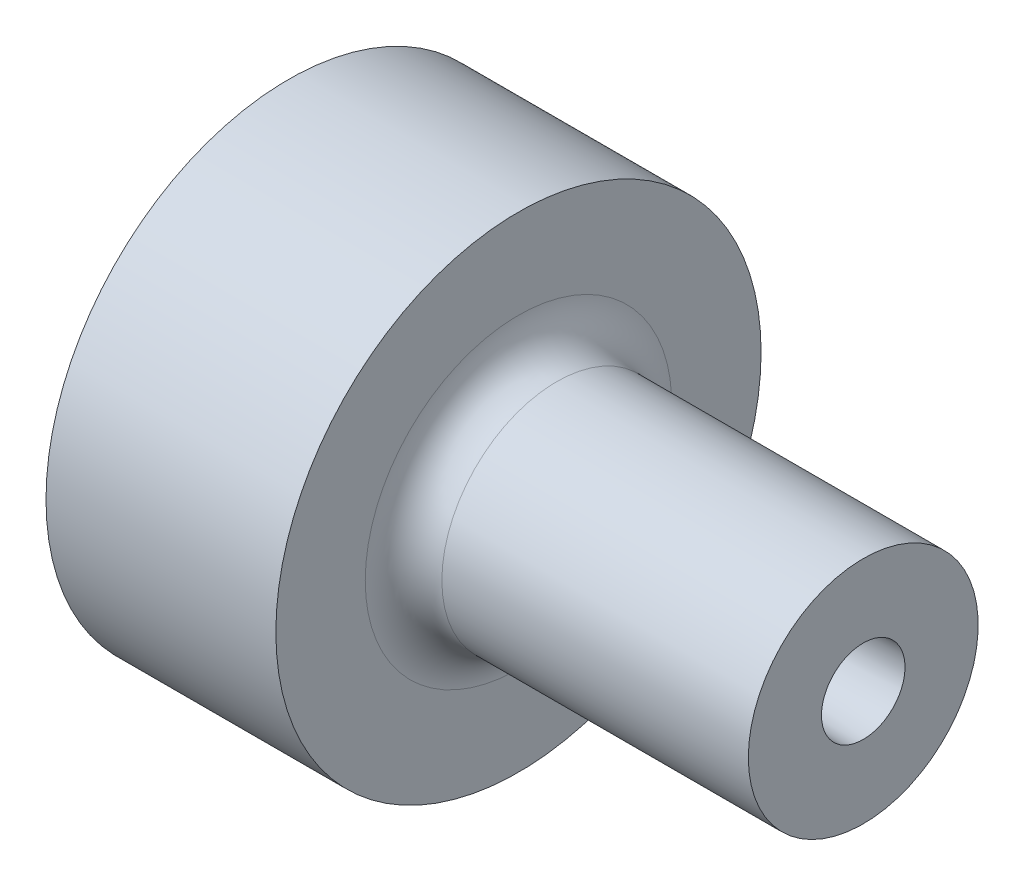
ISO-10303-21;
HEADER;
FILE_DESCRIPTION(('STEP AP214'),'2;1');
FILE_NAME('part.step','',(''),(''),'','','');
FILE_SCHEMA(('AUTOMOTIVE_DESIGN { 1 0 10303 214 1 1 1 1 }'));
ENDSEC;
DATA;
#1=APPLICATION_CONTEXT('core data for automotive mechanical design processes');
#2=APPLICATION_PROTOCOL_DEFINITION('international standard','automotive_design',2000,#1);
#3=PRODUCT_CONTEXT('',#1,'mechanical');
#4=PRODUCT('Part','Part','',(#3));
#5=PRODUCT_RELATED_PRODUCT_CATEGORY('part','',(#4));
#6=PRODUCT_DEFINITION_FORMATION('','',#4);
#7=PRODUCT_DEFINITION_CONTEXT('part definition',#1,'design');
#8=PRODUCT_DEFINITION('design','',#6,#7);
#9=PRODUCT_DEFINITION_SHAPE('','',#8);
#10=(LENGTH_UNIT() NAMED_UNIT(*) SI_UNIT(.MILLI.,.METRE.));
#11=(NAMED_UNIT(*) PLANE_ANGLE_UNIT() SI_UNIT($,.RADIAN.));
#12=(NAMED_UNIT(*) SI_UNIT($,.STERADIAN.) SOLID_ANGLE_UNIT());
#13=UNCERTAINTY_MEASURE_WITH_UNIT(LENGTH_MEASURE(1.E-05),#10,'distance_accuracy_value','');
#14=(GEOMETRIC_REPRESENTATION_CONTEXT(3) GLOBAL_UNCERTAINTY_ASSIGNED_CONTEXT((#13)) GLOBAL_UNIT_ASSIGNED_CONTEXT((#10,
#11,#12)) REPRESENTATION_CONTEXT('',''));
#15=CARTESIAN_POINT('',(0.,0.,0.));
#16=DIRECTION('',(0.,0.,1.));
#17=DIRECTION('',(1.,0.,0.));
#18=AXIS2_PLACEMENT_3D('',#15,#16,#17);
#19=CARTESIAN_POINT('',(0.,0.,0.));
#20=DIRECTION('',(-1.,0.,0.));
#21=DIRECTION('',(0.,0.,1.));
#22=AXIS2_PLACEMENT_3D('',#19,#20,#21);
#23=CYLINDRICAL_SURFACE('',#22,19.);
#24=CARTESIAN_POINT('',(18.,0.,0.));
#25=DIRECTION('',(-1.,0.,0.));
#26=DIRECTION('',(0.,0.,1.));
#27=AXIS2_PLACEMENT_3D('',#24,#25,#26);
#28=CIRCLE('',#27,19.);
#29=CARTESIAN_POINT('',(18.,0.,19.));
#30=VERTEX_POINT('',#29);
#31=EDGE_CURVE('E90',#30,#30,#28,.T.);
#32=ORIENTED_EDGE('',*,*,#31,.T.);
#33=EDGE_LOOP('',(#32));
#34=FACE_BOUND('',#33,.T.);
#35=CARTESIAN_POINT('',(0.,0.,0.));
#36=DIRECTION('',(-1.,0.,0.));
#37=DIRECTION('',(0.,0.,1.));
#38=AXIS2_PLACEMENT_3D('',#35,#36,#37);
#39=CIRCLE('',#38,19.);
#40=CARTESIAN_POINT('',(0.,0.,19.));
#41=VERTEX_POINT('',#40);
#42=EDGE_CURVE('E85',#41,#41,#39,.T.);
#43=ORIENTED_EDGE('',*,*,#42,.F.);
#44=EDGE_LOOP('',(#43));
#45=FACE_BOUND('',#44,.T.);
#46=CARTESIAN_POINT('',(11.,-19.,0.));
#47=CARTESIAN_POINT('',(10.9999951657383,-18.9999986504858,0.11200841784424));
#48=CARTESIAN_POINT('',(10.9905588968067,-18.9989990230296,0.224090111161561));
#49=CARTESIAN_POINT('',(10.953059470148,-18.9951074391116,0.445143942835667));
#50=CARTESIAN_POINT('',(10.9249759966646,-18.9922134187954,0.554112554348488));
#51=CARTESIAN_POINT('',(10.8510107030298,-18.9848596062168,0.765707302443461));
#52=CARTESIAN_POINT('',(10.8051398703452,-18.9804007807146,0.868337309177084));
#53=CARTESIAN_POINT('',(10.696923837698,-18.9704154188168,1.06441973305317));
#54=CARTESIAN_POINT('',(10.6345818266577,-18.9648890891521,1.15787392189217));
#55=CARTESIAN_POINT('',(10.494927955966,-18.9533628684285,1.33334438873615));
#56=CARTESIAN_POINT('',(10.417564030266,-18.9473613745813,1.41531912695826));
#57=CARTESIAN_POINT('',(10.2501736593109,-18.9355744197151,1.565146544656));
#58=CARTESIAN_POINT('',(10.1601466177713,-18.9297889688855,1.63299855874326));
#59=CARTESIAN_POINT('',(9.96972339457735,-18.9190729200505,1.75280323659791));
#60=CARTESIAN_POINT('',(9.86930325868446,-18.914144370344,1.80471802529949));
#61=CARTESIAN_POINT('',(9.66111022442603,-18.9057203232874,1.89093273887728));
#62=CARTESIAN_POINT('',(9.55333752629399,-18.90222478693,1.92523314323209));
#63=CARTESIAN_POINT('',(9.333924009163,-18.8970772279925,1.97512160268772));
#64=CARTESIAN_POINT('',(9.22229908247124,-18.89541839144,1.99077883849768));
#65=CARTESIAN_POINT('',(8.99799439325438,-18.8941109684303,2.0031504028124));
#66=CARTESIAN_POINT('',(8.88531466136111,-18.8944623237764,1.99986527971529));
#67=CARTESIAN_POINT('',(8.66257681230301,-18.8971293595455,1.97450235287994));
#68=CARTESIAN_POINT('',(8.55250997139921,-18.8994371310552,1.9525002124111));
#69=CARTESIAN_POINT('',(8.33763983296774,-18.9057446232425,1.89044560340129));
#70=CARTESIAN_POINT('',(8.23283661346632,-18.9097443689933,1.85039286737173));
#71=CARTESIAN_POINT('',(8.0312304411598,-18.9189942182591,1.75329092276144));
#72=CARTESIAN_POINT('',(7.93444370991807,-18.924246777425,1.69620827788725));
#73=CARTESIAN_POINT('',(7.75179548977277,-18.9354083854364,1.5666908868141));
#74=CARTESIAN_POINT('',(7.66593435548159,-18.9413174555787,1.49425564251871));
#75=CARTESIAN_POINT('',(7.50713503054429,-18.9531615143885,1.33566725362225));
#76=CARTESIAN_POINT('',(7.43426205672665,-18.9590964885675,1.24944878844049));
#77=CARTESIAN_POINT('',(7.30401357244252,-18.9702964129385,1.06596783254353));
#78=CARTESIAN_POINT('',(7.24663808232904,-18.9755613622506,0.968705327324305));
#79=CARTESIAN_POINT('',(7.14901535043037,-18.9848300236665,0.765851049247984));
#80=CARTESIAN_POINT('',(7.10877156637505,-18.9888334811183,0.660257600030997));
#81=CARTESIAN_POINT('',(7.04660317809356,-18.9951255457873,0.443760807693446));
#82=CARTESIAN_POINT('',(7.02467796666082,-18.9974142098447,0.332857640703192));
#83=CARTESIAN_POINT('',(6.9998521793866,-19.0000115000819,0.109454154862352));
#84=CARTESIAN_POINT('',(6.9968616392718,-19.0003294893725,-0.00303606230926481));
#85=CARTESIAN_POINT('',(7.00975357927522,-18.9989747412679,-0.226916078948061));
#86=CARTESIAN_POINT('',(7.02563577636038,-18.9973020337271,-0.338305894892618));
#87=CARTESIAN_POINT('',(7.07574769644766,-18.9921598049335,-0.556562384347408));
#88=CARTESIAN_POINT('',(7.10993514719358,-18.9886944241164,-0.663438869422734));
#89=CARTESIAN_POINT('',(7.1956435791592,-18.9803554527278,-0.869940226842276));
#90=CARTESIAN_POINT('',(7.24716498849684,-18.9754818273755,-0.969564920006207));
#91=CARTESIAN_POINT('',(7.36630089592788,-18.9648478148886,-1.1591405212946));
#92=CARTESIAN_POINT('',(7.43397432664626,-18.9590842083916,-1.2490542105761));
#93=CARTESIAN_POINT('',(7.58340899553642,-18.9473268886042,-1.4162783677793));
#94=CARTESIAN_POINT('',(7.665170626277,-18.9413331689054,-1.49358848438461));
#95=CARTESIAN_POINT('',(7.84085406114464,-18.9297628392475,-1.63372463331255));
#96=CARTESIAN_POINT('',(7.93482318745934,-18.9241879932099,-1.69649150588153));
#97=CARTESIAN_POINT('',(8.13202150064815,-18.9141138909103,-1.80535237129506));
#98=CARTESIAN_POINT('',(8.23525054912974,-18.9096146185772,-1.85144661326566));
#99=CARTESIAN_POINT('',(8.44783784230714,-18.9022123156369,-1.9255553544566));
#100=CARTESIAN_POINT('',(8.55718382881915,-18.8993062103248,-1.95360469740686));
#101=CARTESIAN_POINT('',(8.77906579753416,-18.8954098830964,-1.99094032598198));
#102=CARTESIAN_POINT('',(8.89160167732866,-18.8944195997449,-2.00022721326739));
#103=CARTESIAN_POINT('',(9.11608086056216,-18.8944684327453,-1.99976544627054));
#104=CARTESIAN_POINT('',(9.22802436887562,-18.8954976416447,-1.99010972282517));
#105=CARTESIAN_POINT('',(9.4486892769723,-18.8994483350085,-1.95223204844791));
#106=CARTESIAN_POINT('',(9.55741067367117,-18.9023698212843,-1.92401007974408));
#107=CARTESIAN_POINT('',(9.76854219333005,-18.9097730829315,-1.8498273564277));
#108=CARTESIAN_POINT('',(9.87095340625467,-18.914254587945,-1.80386967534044));
#109=CARTESIAN_POINT('',(10.0666237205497,-18.92427346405,-1.69552954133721));
#110=CARTESIAN_POINT('',(10.1598828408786,-18.9298108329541,-1.63314712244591));
#111=CARTESIAN_POINT('',(10.3350778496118,-18.9413500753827,-1.49337993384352));
#112=CARTESIAN_POINT('',(10.4169583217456,-18.9473540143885,-1.41592586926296));
#113=CARTESIAN_POINT('',(10.5665993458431,-18.9591311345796,-1.24835332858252));
#114=CARTESIAN_POINT('',(10.6343565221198,-18.9649042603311,-1.15823183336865));
#115=CARTESIAN_POINT('',(10.7539774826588,-18.975586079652,-0.967607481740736));
#116=CARTESIAN_POINT('',(10.8057969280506,-18.9804923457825,-0.867076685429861));
#117=CARTESIAN_POINT('',(10.8917493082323,-18.9888617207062,-0.658751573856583));
#118=CARTESIAN_POINT('',(10.9259020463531,-18.9923264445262,-0.550965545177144));
#119=CARTESIAN_POINT('',(10.9671005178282,-18.9965585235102,-0.368815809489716));
#120=CARTESIAN_POINT('',(10.9794208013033,-18.9978430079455,-0.295613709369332));
#121=CARTESIAN_POINT('',(10.9958721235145,-18.9995641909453,-0.148285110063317));
#122=CARTESIAN_POINT('',(11.0000032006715,-19.0000008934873,-0.0741586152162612));
#123=CARTESIAN_POINT('',(11.,-19.,0.));
#124=B_SPLINE_CURVE_WITH_KNOTS('',3,(#46,#47,#48,#49,#50,#51,#52,#53,#54,#55,#56,#57,#58,#59,
#60,#61,#62,#63,#64,#65,#66,#67,#68,#69,#70,#71,#72,#73,#74,#75,#76,#77,#78,#79,#80,#81,#82,#83,
#84,#85,#86,#87,#88,#89,#90,#91,#92,#93,#94,#95,#96,#97,#98,#99,#100,#101,#102,#103,#104,#105,
#106,#107,#108,#109,#110,#111,#112,#113,#114,#115,#116,#117,#118,#119,#120,#121,#122,#123),
.UNSPECIFIED.,.T.,.F.,(4,2,2,2,2,2,2,2,2,2,2,2,2,2,2,2,2,2,2,2,2,2,2,2,2,2,2,2,2,2,2,2,2,2,2,2,
2,2,4),(0.,0.335754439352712,0.671875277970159,1.00778882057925,1.34363737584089,
1.68067146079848,2.01772142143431,2.35556629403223,2.69340196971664,3.02998006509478,
3.36654841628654,3.7017626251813,4.03698180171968,4.37286352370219,4.70875614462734,
5.0462905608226,5.38382542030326,5.72142837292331,6.05902013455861,6.39500668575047,
6.73098819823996,7.06619715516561,7.40141439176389,7.73787392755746,8.07434284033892,
8.41215732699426,8.74996676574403,9.08712193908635,9.42426630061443,9.75976079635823,
10.095255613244,10.4306923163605,10.7661283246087,11.103144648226,11.4402414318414,
11.7782677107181,12.1159142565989,12.3382118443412,12.5605083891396),.UNSPECIFIED.);
#125=CARTESIAN_POINT('',(11.,-19.,0.));
#126=VERTEX_POINT('',#125);
#127=EDGE_CURVE('E10',#126,#126,#124,.T.);
#128=ORIENTED_EDGE('',*,*,#127,.F.);
#129=EDGE_LOOP('',(#128));
#130=FACE_BOUND('',#129,.T.);
#131=ADVANCED_FACE('F16',(#34,#45,#130),#23,.T.);
#132=CARTESIAN_POINT('',(0.,0.,0.));
#133=DIRECTION('',(1.,0.,0.));
#134=DIRECTION('',(0.,0.,-1.));
#135=AXIS2_PLACEMENT_3D('',#132,#133,#134);
#136=CONICAL_SURFACE('',#135,2.25,0.0226892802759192);
#137=CARTESIAN_POINT('',(45.,0.,0.));
#138=DIRECTION('',(-1.,0.,0.));
#139=DIRECTION('',(0.,0.,1.));
#140=AXIS2_PLACEMENT_3D('',#137,#138,#139);
#141=CIRCLE('',#140,3.27119285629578);
#142=CARTESIAN_POINT('',(45.,0.,3.27119285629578));
#143=VERTEX_POINT('',#142);
#144=EDGE_CURVE('E77',#143,#143,#141,.T.);
#145=ORIENTED_EDGE('',*,*,#144,.F.);
#146=EDGE_LOOP('',(#145));
#147=FACE_BOUND('',#146,.T.);
#148=CARTESIAN_POINT('',(3.81173528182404,0.,0.));
#149=DIRECTION('',(-1.,0.,0.));
#150=DIRECTION('',(0.,0.,1.));
#151=AXIS2_PLACEMENT_3D('',#148,#149,#150);
#152=CIRCLE('',#151,2.33650037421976);
#153=CARTESIAN_POINT('',(3.81173528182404,0.,2.33650037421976));
#154=VERTEX_POINT('',#153);
#155=EDGE_CURVE('E96',#154,#154,#152,.F.);
#156=ORIENTED_EDGE('',*,*,#155,.F.);
#157=EDGE_LOOP('',(#156));
#158=FACE_BOUND('',#157,.T.);
#159=ADVANCED_FACE('F44',(#147,#158),#136,.F.);
#160=CARTESIAN_POINT('',(21.,0.,0.));
#161=DIRECTION('',(-1.,0.,0.));
#162=DIRECTION('',(0.,0.,1.));
#163=AXIS2_PLACEMENT_3D('',#160,#161,#162);
#164=TOROIDAL_SURFACE('',#163,12.,3.);
#165=CARTESIAN_POINT('',(18.,0.,0.));
#166=DIRECTION('',(-1.,0.,0.));
#167=DIRECTION('',(0.,0.,1.));
#168=AXIS2_PLACEMENT_3D('',#165,#166,#167);
#169=CIRCLE('',#168,12.);
#170=CARTESIAN_POINT('',(18.,0.,12.));
#171=VERTEX_POINT('',#170);
#172=EDGE_CURVE('E93',#171,#171,#169,.T.);
#173=ORIENTED_EDGE('',*,*,#172,.F.);
#174=EDGE_LOOP('',(#173));
#175=FACE_BOUND('',#174,.T.);
#176=CARTESIAN_POINT('',(21.,0.,0.));
#177=DIRECTION('',(-1.,0.,0.));
#178=DIRECTION('',(0.,0.,1.));
#179=AXIS2_PLACEMENT_3D('',#176,#177,#178);
#180=CIRCLE('',#179,9.);
#181=CARTESIAN_POINT('',(21.,0.,9.));
#182=VERTEX_POINT('',#181);
#183=EDGE_CURVE('E29',#182,#182,#180,.T.);
#184=ORIENTED_EDGE('',*,*,#183,.T.);
#185=EDGE_LOOP('',(#184));
#186=FACE_BOUND('',#185,.T.);
#187=ADVANCED_FACE('F18',(#175,#186),#164,.F.);
#188=CARTESIAN_POINT('',(0.,0.,0.));
#189=DIRECTION('',(-1.,0.,0.));
#190=DIRECTION('',(0.,0.,1.));
#191=AXIS2_PLACEMENT_3D('',#188,#189,#190);
#192=CYLINDRICAL_SURFACE('',#191,9.);
#193=ORIENTED_EDGE('',*,*,#183,.F.);
#194=EDGE_LOOP('',(#193));
#195=FACE_BOUND('',#194,.T.);
#196=CARTESIAN_POINT('',(45.,0.,0.));
#197=DIRECTION('',(-1.,0.,0.));
#198=DIRECTION('',(0.,0.,1.));
#199=AXIS2_PLACEMENT_3D('',#196,#197,#198);
#200=CIRCLE('',#199,9.);
#201=CARTESIAN_POINT('',(45.,0.,9.));
#202=VERTEX_POINT('',#201);
#203=EDGE_CURVE('E75',#202,#202,#200,.T.);
#204=ORIENTED_EDGE('',*,*,#203,.T.);
#205=EDGE_LOOP('',(#204));
#206=FACE_BOUND('',#205,.T.);
#207=ADVANCED_FACE('F63',(#195,#206),#192,.T.);
#208=CARTESIAN_POINT('',(45.,9.,0.));
#209=DIRECTION('',(-1.,0.,0.));
#210=DIRECTION('',(0.,0.,1.));
#211=AXIS2_PLACEMENT_3D('',#208,#209,#210);
#212=PLANE('',#211);
#213=ORIENTED_EDGE('',*,*,#203,.F.);
#214=EDGE_LOOP('',(#213));
#215=FACE_BOUND('',#214,.T.);
#216=ORIENTED_EDGE('',*,*,#144,.T.);
#217=EDGE_LOOP('',(#216));
#218=FACE_BOUND('',#217,.T.);
#219=ADVANCED_FACE('F59',(#215,#218),#212,.F.);
#220=CARTESIAN_POINT('',(0.,2.25,0.));
#221=DIRECTION('',(1.,0.,0.));
#222=DIRECTION('',(0.,0.,-1.));
#223=AXIS2_PLACEMENT_3D('',#220,#221,#222);
#224=PLANE('',#223);
#225=CARTESIAN_POINT('',(0.,0.,0.));
#226=DIRECTION('',(-1.,0.,0.));
#227=DIRECTION('',(0.,0.,1.));
#228=AXIS2_PLACEMENT_3D('',#225,#226,#227);
#229=CIRCLE('',#228,15.5);
#230=CARTESIAN_POINT('',(0.,0.,15.5));
#231=VERTEX_POINT('',#230);
#232=EDGE_CURVE('E100',#231,#231,#229,.T.);
#233=ORIENTED_EDGE('',*,*,#232,.F.);
#234=EDGE_LOOP('',(#233));
#235=FACE_BOUND('',#234,.T.);
#236=ORIENTED_EDGE('',*,*,#42,.T.);
#237=EDGE_LOOP('',(#236));
#238=FACE_BOUND('',#237,.T.);
#239=ADVANCED_FACE('F57',(#235,#238),#224,.F.);
#240=CARTESIAN_POINT('',(18.,19.,0.));
#241=DIRECTION('',(-1.,0.,0.));
#242=DIRECTION('',(0.,0.,1.));
#243=AXIS2_PLACEMENT_3D('',#240,#241,#242);
#244=PLANE('',#243);
#245=ORIENTED_EDGE('',*,*,#31,.F.);
#246=EDGE_LOOP('',(#245));
#247=FACE_BOUND('',#246,.T.);
#248=ORIENTED_EDGE('',*,*,#172,.T.);
#249=EDGE_LOOP('',(#248));
#250=FACE_BOUND('',#249,.T.);
#251=ADVANCED_FACE('F55',(#247,#250),#244,.F.);
#252=CARTESIAN_POINT('',(-35.9477938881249,0.,0.));
#253=DIRECTION('',(-1.,0.,0.));
#254=DIRECTION('',(0.,0.,1.));
#255=AXIS2_PLACEMENT_3D('',#252,#253,#254);
#256=DEGENERATE_TOROIDAL_SURFACE('',#255,2.0429790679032,40.,.F.);
#257=ORIENTED_EDGE('',*,*,#232,.T.);
#258=EDGE_LOOP('',(#257));
#259=FACE_BOUND('',#258,.T.);
#260=ORIENTED_EDGE('',*,*,#155,.T.);
#261=EDGE_LOOP('',(#260));
#262=FACE_BOUND('',#261,.T.);
#263=ADVANCED_FACE('F40',(#259,#262),#256,.T.);
#264=CARTESIAN_POINT('',(9.,-19.,0.));
#265=DIRECTION('',(0.,-1.,0.));
#266=DIRECTION('',(1.,0.,0.));
#267=AXIS2_PLACEMENT_3D('',#264,#265,#266);
#268=CYLINDRICAL_SURFACE('',#267,2.);
#269=CARTESIAN_POINT('',(9.,-13.,0.));
#270=DIRECTION('',(0.,-1.,0.));
#271=DIRECTION('',(1.,0.,0.));
#272=AXIS2_PLACEMENT_3D('',#269,#270,#271);
#273=CIRCLE('',#272,2.);
#274=CARTESIAN_POINT('',(11.,-13.,0.));
#275=VERTEX_POINT('',#274);
#276=EDGE_CURVE('E104',#275,#275,#273,.T.);
#277=ORIENTED_EDGE('',*,*,#276,.F.);
#278=EDGE_LOOP('',(#277));
#279=FACE_BOUND('',#278,.T.);
#280=ORIENTED_EDGE('',*,*,#127,.T.);
#281=EDGE_LOOP('',(#280));
#282=FACE_BOUND('',#281,.T.);
#283=ADVANCED_FACE('F34',(#279,#282),#268,.F.);
#284=CARTESIAN_POINT('',(9.,-11.8452994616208,0.));
#285=DIRECTION('',(0.,-1.,0.));
#286=DIRECTION('',(1.,0.,0.));
#287=AXIS2_PLACEMENT_3D('',#284,#285,#286);
#288=CONICAL_SURFACE('',#287,0.,1.0471975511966);
#289=ORIENTED_EDGE('',*,*,#276,.T.);
#290=EDGE_LOOP('',(#289));
#291=FACE_BOUND('',#290,.T.);
#292=CARTESIAN_POINT('',(9.,-11.8452994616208,0.));
#293=VERTEX_POINT('',#292);
#294=VERTEX_LOOP('',#293);
#295=FACE_BOUND('',#294,.T.);
#296=ADVANCED_FACE('F32',(#291,#295),#288,.F.);
#297=CLOSED_SHELL('',(#131,#159,#187,#207,#219,#239,#251,#263,#283,#296));
#298=MANIFOLD_SOLID_BREP('B1',#297);
#299=ADVANCED_BREP_SHAPE_REPRESENTATION('',(#18,#298),#14);
#300=SHAPE_DEFINITION_REPRESENTATION(#9,#299);
ENDSEC;
END-ISO-10303-21;
